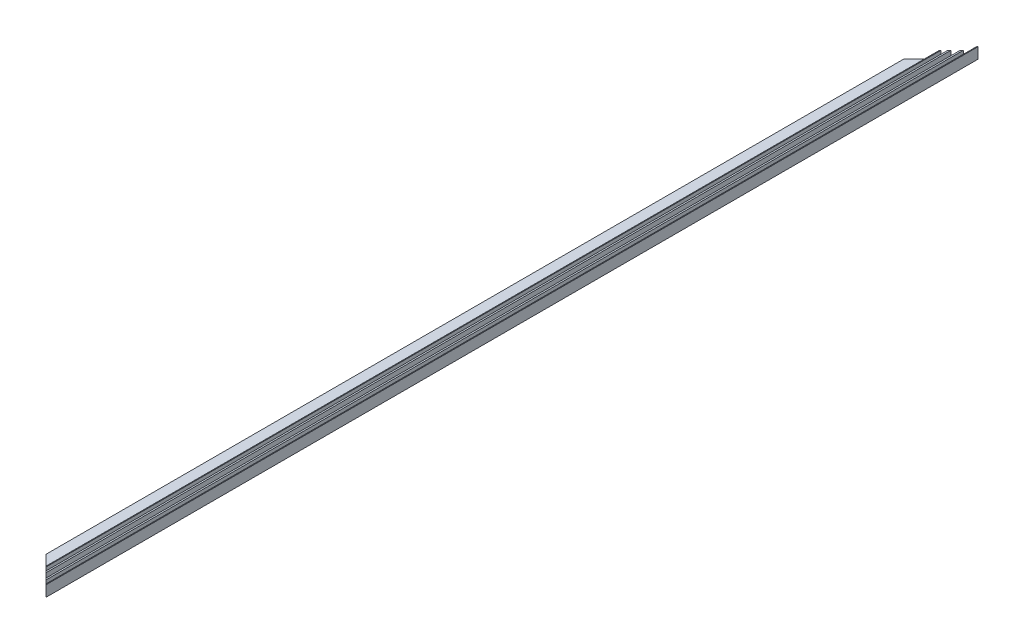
ISO-10303-21;
HEADER;
FILE_DESCRIPTION(('STEP AP214'),'2;1');
FILE_NAME('part.step','',(''),(''),'','','');
FILE_SCHEMA(('AUTOMOTIVE_DESIGN { 1 0 10303 214 1 1 1 1 }'));
ENDSEC;
DATA;
#1=APPLICATION_CONTEXT('core data for automotive mechanical design processes');
#2=APPLICATION_PROTOCOL_DEFINITION('international standard','automotive_design',2000,#1);
#3=PRODUCT_CONTEXT('',#1,'mechanical');
#4=PRODUCT('Part','Part','',(#3));
#5=PRODUCT_RELATED_PRODUCT_CATEGORY('part','',(#4));
#6=PRODUCT_DEFINITION_FORMATION('','',#4);
#7=PRODUCT_DEFINITION_CONTEXT('part definition',#1,'design');
#8=PRODUCT_DEFINITION('design','',#6,#7);
#9=PRODUCT_DEFINITION_SHAPE('','',#8);
#10=(LENGTH_UNIT() NAMED_UNIT(*) SI_UNIT(.MILLI.,.METRE.));
#11=(NAMED_UNIT(*) PLANE_ANGLE_UNIT() SI_UNIT($,.RADIAN.));
#12=(NAMED_UNIT(*) SI_UNIT($,.STERADIAN.) SOLID_ANGLE_UNIT());
#13=UNCERTAINTY_MEASURE_WITH_UNIT(LENGTH_MEASURE(1.E-05),#10,'distance_accuracy_value','');
#14=(GEOMETRIC_REPRESENTATION_CONTEXT(3) GLOBAL_UNCERTAINTY_ASSIGNED_CONTEXT((#13)) GLOBAL_UNIT_ASSIGNED_CONTEXT((#10,
#11,#12)) REPRESENTATION_CONTEXT('',''));
#15=CARTESIAN_POINT('',(0.,0.,0.));
#16=DIRECTION('',(0.,0.,1.));
#17=DIRECTION('',(1.,0.,0.));
#18=AXIS2_PLACEMENT_3D('',#15,#16,#17);
#19=CARTESIAN_POINT('',(-51.5554088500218,5.5,600.));
#20=DIRECTION('',(1.,0.,0.));
#21=DIRECTION('',(0.,0.,-1.));
#22=AXIS2_PLACEMENT_3D('',#19,#20,#21);
#23=PLANE('',#22);
#24=DIRECTION('',(0.,0.,-1.));
#25=VECTOR('',#24,1.);
#26=CARTESIAN_POINT('',(-51.5554088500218,0.50575390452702,600.));
#27=LINE('',#26,#25);
#28=CARTESIAN_POINT('',(-51.5554088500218,0.50575390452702,587.6));
#29=VERTEX_POINT('',#28);
#30=CARTESIAN_POINT('',(-51.5554088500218,0.50575390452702,12.3999999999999));
#31=VERTEX_POINT('',#30);
#32=EDGE_CURVE('E11',#29,#31,#27,.T.);
#33=ORIENTED_EDGE('',*,*,#32,.F.);
#34=DIRECTION('',(0.,1.,0.));
#35=VECTOR('',#34,1.);
#36=CARTESIAN_POINT('',(-51.5554088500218,5.5,587.6));
#37=LINE('',#36,#35);
#38=CARTESIAN_POINT('',(-51.5554088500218,5.5,587.6));
#39=VERTEX_POINT('',#38);
#40=EDGE_CURVE('E308',#29,#39,#37,.T.);
#41=ORIENTED_EDGE('',*,*,#40,.T.);
#42=DIRECTION('',(0.,0.,-1.));
#43=VECTOR('',#42,1.);
#44=CARTESIAN_POINT('',(-51.5554088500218,5.5,600.));
#45=LINE('',#44,#43);
#46=CARTESIAN_POINT('',(-51.5554088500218,5.5,12.3999999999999));
#47=VERTEX_POINT('',#46);
#48=EDGE_CURVE('E237',#39,#47,#45,.T.);
#49=ORIENTED_EDGE('',*,*,#48,.T.);
#50=DIRECTION('',(0.,-1.,0.));
#51=VECTOR('',#50,1.);
#52=CARTESIAN_POINT('',(-51.5554088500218,5.5,12.3999999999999));
#53=LINE('',#52,#51);
#54=EDGE_CURVE('E253',#47,#31,#53,.T.);
#55=ORIENTED_EDGE('',*,*,#54,.T.);
#56=EDGE_LOOP('',(#33,#41,#49,#55));
#57=FACE_BOUND('',#56,.T.);
#58=ADVANCED_FACE('F33',(#57),#23,.F.);
#59=CARTESIAN_POINT('',(-51.5554088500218,0.50575390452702,600.));
#60=DIRECTION('',(0.,-1.,0.));
#61=DIRECTION('',(1.,0.,0.));
#62=AXIS2_PLACEMENT_3D('',#59,#60,#61);
#63=PLANE('',#62);
#64=DIRECTION('',(0.,0.,-1.));
#65=VECTOR('',#64,1.);
#66=CARTESIAN_POINT('',(-63.1554088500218,0.505753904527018,600.));
#67=LINE('',#66,#65);
#68=CARTESIAN_POINT('',(-63.1554088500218,0.505753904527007,576.));
#69=VERTEX_POINT('',#68);
#70=CARTESIAN_POINT('',(-63.1554088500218,0.505753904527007,23.9999999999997));
#71=VERTEX_POINT('',#70);
#72=EDGE_CURVE('E41',#69,#71,#67,.T.);
#73=ORIENTED_EDGE('',*,*,#72,.F.);
#74=DIRECTION('',(0.707106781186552,0.,0.707106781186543));
#75=VECTOR('',#74,1.);
#76=CARTESIAN_POINT('',(-45.3554088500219,0.50575390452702,593.8));
#77=LINE('',#76,#75);
#78=EDGE_CURVE('E180',#69,#29,#77,.T.);
#79=ORIENTED_EDGE('',*,*,#78,.T.);
#80=ORIENTED_EDGE('',*,*,#32,.T.);
#81=DIRECTION('',(-0.707106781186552,0.,0.707106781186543));
#82=VECTOR('',#81,1.);
#83=CARTESIAN_POINT('',(-345.355408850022,0.505753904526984,306.199999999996));
#84=LINE('',#83,#82);
#85=EDGE_CURVE('E250',#31,#71,#84,.T.);
#86=ORIENTED_EDGE('',*,*,#85,.T.);
#87=EDGE_LOOP('',(#73,#79,#80,#86));
#88=FACE_BOUND('',#87,.T.);
#89=ADVANCED_FACE('F429',(#88),#63,.F.);
#90=CARTESIAN_POINT('',(-63.1554088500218,0.505753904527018,600.));
#91=DIRECTION('',(1.,0.,0.));
#92=DIRECTION('',(0.,0.,-1.));
#93=AXIS2_PLACEMENT_3D('',#90,#91,#92);
#94=PLANE('',#93);
#95=DIRECTION('',(0.,0.,-1.));
#96=VECTOR('',#95,1.);
#97=CARTESIAN_POINT('',(-63.1554088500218,0.,600.));
#98=LINE('',#97,#96);
#99=CARTESIAN_POINT('',(-63.1554088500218,0.,576.));
#100=VERTEX_POINT('',#99);
#101=CARTESIAN_POINT('',(-63.1554088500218,0.,23.9999999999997));
#102=VERTEX_POINT('',#101);
#103=EDGE_CURVE('E190',#100,#102,#98,.T.);
#104=ORIENTED_EDGE('',*,*,#103,.F.);
#105=DIRECTION('',(0.,-1.,0.));
#106=VECTOR('',#105,1.);
#107=CARTESIAN_POINT('',(-63.1554088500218,600.,576.));
#108=LINE('',#107,#106);
#109=EDGE_CURVE('E174',#69,#100,#108,.T.);
#110=ORIENTED_EDGE('',*,*,#109,.F.);
#111=ORIENTED_EDGE('',*,*,#72,.T.);
#112=DIRECTION('',(0.,-1.,0.));
#113=VECTOR('',#112,1.);
#114=CARTESIAN_POINT('',(-63.1554088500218,600.,23.9999999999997));
#115=LINE('',#114,#113);
#116=EDGE_CURVE('E197',#71,#102,#115,.T.);
#117=ORIENTED_EDGE('',*,*,#116,.T.);
#118=EDGE_LOOP('',(#104,#110,#111,#117));
#119=FACE_BOUND('',#118,.T.);
#120=ADVANCED_FACE('F195',(#119),#94,.F.);
#121=CARTESIAN_POINT('',(-63.1554088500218,0.,600.));
#122=DIRECTION('',(0.,1.,0.));
#123=DIRECTION('',(0.,0.,1.));
#124=AXIS2_PLACEMENT_3D('',#121,#122,#123);
#125=PLANE('',#124);
#126=DIRECTION('',(0.,0.,-1.));
#127=VECTOR('',#126,1.);
#128=CARTESIAN_POINT('',(-51.1554088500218,0.,600.));
#129=LINE('',#128,#127);
#130=CARTESIAN_POINT('',(-51.1554088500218,0.,588.));
#131=VERTEX_POINT('',#130);
#132=CARTESIAN_POINT('',(-51.1554088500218,0.,11.9999999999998));
#133=VERTEX_POINT('',#132);
#134=EDGE_CURVE('E192',#131,#133,#129,.T.);
#135=ORIENTED_EDGE('',*,*,#134,.F.);
#136=DIRECTION('',(0.707106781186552,0.,0.707106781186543));
#137=VECTOR('',#136,1.);
#138=CARTESIAN_POINT('',(-39.1554088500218,0.,600.));
#139=LINE('',#138,#137);
#140=EDGE_CURVE('E177',#100,#131,#139,.T.);
#141=ORIENTED_EDGE('',*,*,#140,.F.);
#142=ORIENTED_EDGE('',*,*,#103,.T.);
#143=DIRECTION('',(-0.707106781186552,0.,0.707106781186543));
#144=VECTOR('',#143,1.);
#145=CARTESIAN_POINT('',(-39.1554088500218,0.,0.));
#146=LINE('',#145,#144);
#147=EDGE_CURVE('E302',#133,#102,#146,.T.);
#148=ORIENTED_EDGE('',*,*,#147,.F.);
#149=EDGE_LOOP('',(#135,#141,#142,#148));
#150=FACE_BOUND('',#149,.T.);
#151=ADVANCED_FACE('F188',(#150),#125,.F.);
#152=CARTESIAN_POINT('',(-51.1554088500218,0.,600.));
#153=DIRECTION('',(-1.,0.,0.));
#154=DIRECTION('',(0.,0.,1.));
#155=AXIS2_PLACEMENT_3D('',#152,#153,#154);
#156=PLANE('',#155);
#157=DIRECTION('',(0.,0.,-1.));
#158=VECTOR('',#157,1.);
#159=CARTESIAN_POINT('',(-51.1554088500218,0.5,600.));
#160=LINE('',#159,#158);
#161=CARTESIAN_POINT('',(-51.1554088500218,0.5,588.));
#162=VERTEX_POINT('',#161);
#163=CARTESIAN_POINT('',(-51.1554088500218,0.5,11.9999999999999));
#164=VERTEX_POINT('',#163);
#165=EDGE_CURVE('E199',#162,#164,#160,.T.);
#166=ORIENTED_EDGE('',*,*,#165,.F.);
#167=DIRECTION('',(0.,-1.,0.));
#168=VECTOR('',#167,1.);
#169=CARTESIAN_POINT('',(-51.1554088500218,0.,588.));
#170=LINE('',#169,#168);
#171=EDGE_CURVE('E304',#162,#131,#170,.T.);
#172=ORIENTED_EDGE('',*,*,#171,.T.);
#173=ORIENTED_EDGE('',*,*,#134,.T.);
#174=DIRECTION('',(0.,1.,0.));
#175=VECTOR('',#174,1.);
#176=CARTESIAN_POINT('',(-51.1554088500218,0.,11.9999999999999));
#177=LINE('',#176,#175);
#178=EDGE_CURVE('E243',#133,#164,#177,.T.);
#179=ORIENTED_EDGE('',*,*,#178,.T.);
#180=EDGE_LOOP('',(#166,#172,#173,#179));
#181=FACE_BOUND('',#180,.T.);
#182=ADVANCED_FACE('F426',(#181),#156,.F.);
#183=CARTESIAN_POINT('',(-51.1554088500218,0.5,600.));
#184=DIRECTION('',(0.,1.,0.));
#185=DIRECTION('',(0.,0.,1.));
#186=AXIS2_PLACEMENT_3D('',#183,#184,#185);
#187=PLANE('',#186);
#188=DIRECTION('',(0.,0.,-1.));
#189=VECTOR('',#188,1.);
#190=CARTESIAN_POINT('',(-39.1554088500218,0.5,600.));
#191=LINE('',#190,#189);
#192=CARTESIAN_POINT('',(-39.1554088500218,0.5,600.));
#193=VERTEX_POINT('',#192);
#194=CARTESIAN_POINT('',(-39.1554088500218,0.499999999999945,0.));
#195=VERTEX_POINT('',#194);
#196=EDGE_CURVE('E203',#193,#195,#191,.T.);
#197=ORIENTED_EDGE('',*,*,#196,.F.);
#198=DIRECTION('',(-0.707106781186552,0.,-0.707106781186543));
#199=VECTOR('',#198,1.);
#200=CARTESIAN_POINT('',(-45.1554088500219,0.5,594.));
#201=LINE('',#200,#199);
#202=EDGE_CURVE('E47',#193,#162,#201,.T.);
#203=ORIENTED_EDGE('',*,*,#202,.T.);
#204=ORIENTED_EDGE('',*,*,#165,.T.);
#205=DIRECTION('',(0.707106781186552,0.,-0.707106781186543));
#206=VECTOR('',#205,1.);
#207=CARTESIAN_POINT('',(-345.155408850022,0.5,305.999999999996));
#208=LINE('',#207,#206);
#209=EDGE_CURVE('E247',#164,#195,#208,.T.);
#210=ORIENTED_EDGE('',*,*,#209,.T.);
#211=EDGE_LOOP('',(#197,#203,#204,#210));
#212=FACE_BOUND('',#211,.T.);
#213=ADVANCED_FACE('F423',(#212),#187,.F.);
#214=CARTESIAN_POINT('',(-39.1554088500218,0.5,600.));
#215=DIRECTION('',(-1.,0.,0.));
#216=DIRECTION('',(0.,0.,1.));
#217=AXIS2_PLACEMENT_3D('',#214,#215,#216);
#218=PLANE('',#217);
#219=DIRECTION('',(0.,1.,0.));
#220=VECTOR('',#219,1.);
#221=CARTESIAN_POINT('',(-39.1554088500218,0.5,0.));
#222=LINE('',#221,#220);
#223=CARTESIAN_POINT('',(-39.1554088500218,7.5,0.));
#224=VERTEX_POINT('',#223);
#225=EDGE_CURVE('E240',#195,#224,#222,.T.);
#226=ORIENTED_EDGE('',*,*,#225,.T.);
#227=DIRECTION('',(0.,0.,-1.));
#228=VECTOR('',#227,1.);
#229=CARTESIAN_POINT('',(-39.1554088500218,7.5,600.));
#230=LINE('',#229,#228);
#231=CARTESIAN_POINT('',(-39.1554088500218,7.49999999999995,600.));
#232=VERTEX_POINT('',#231);
#233=EDGE_CURVE('E206',#232,#224,#230,.T.);
#234=ORIENTED_EDGE('',*,*,#233,.F.);
#235=DIRECTION('',(0.,1.,0.));
#236=VECTOR('',#235,1.);
#237=CARTESIAN_POINT('',(-39.1554088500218,0.5,600.));
#238=LINE('',#237,#236);
#239=EDGE_CURVE('E239',#193,#232,#238,.T.);
#240=ORIENTED_EDGE('',*,*,#239,.F.);
#241=ORIENTED_EDGE('',*,*,#196,.T.);
#242=EDGE_LOOP('',(#226,#234,#240,#241));
#243=FACE_BOUND('',#242,.T.);
#244=ADVANCED_FACE('F419',(#243),#218,.F.);
#245=CARTESIAN_POINT('',(-39.1554088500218,7.5,600.));
#246=DIRECTION('',(0.,-1.,0.));
#247=DIRECTION('',(0.,0.,-1.));
#248=AXIS2_PLACEMENT_3D('',#245,#246,#247);
#249=PLANE('',#248);
#250=DIRECTION('',(0.,0.,-1.));
#251=VECTOR('',#250,1.);
#252=CARTESIAN_POINT('',(-39.6554088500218,7.5,600.));
#253=LINE('',#252,#251);
#254=CARTESIAN_POINT('',(-39.6554088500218,7.5,599.5));
#255=VERTEX_POINT('',#254);
#256=CARTESIAN_POINT('',(-39.6554088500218,7.5,0.500000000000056));
#257=VERTEX_POINT('',#256);
#258=EDGE_CURVE('E209',#255,#257,#253,.T.);
#259=ORIENTED_EDGE('',*,*,#258,.F.);
#260=DIRECTION('',(0.707106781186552,0.,0.707106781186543));
#261=VECTOR('',#260,1.);
#262=CARTESIAN_POINT('',(-39.1554088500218,7.5,600.));
#263=LINE('',#262,#261);
#264=EDGE_CURVE('E311',#255,#232,#263,.T.);
#265=ORIENTED_EDGE('',*,*,#264,.T.);
#266=ORIENTED_EDGE('',*,*,#233,.T.);
#267=DIRECTION('',(-0.707106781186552,0.,0.707106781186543));
#268=VECTOR('',#267,1.);
#269=CARTESIAN_POINT('',(-339.155408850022,7.5,299.999999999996));
#270=LINE('',#269,#268);
#271=EDGE_CURVE('E256',#224,#257,#270,.T.);
#272=ORIENTED_EDGE('',*,*,#271,.T.);
#273=EDGE_LOOP('',(#259,#265,#266,#272));
#274=FACE_BOUND('',#273,.T.);
#275=ADVANCED_FACE('F415',(#274),#249,.F.);
#276=CARTESIAN_POINT('',(-39.6554088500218,7.5,600.));
#277=DIRECTION('',(1.,0.,0.));
#278=DIRECTION('',(0.,0.,-1.));
#279=AXIS2_PLACEMENT_3D('',#276,#277,#278);
#280=PLANE('',#279);
#281=DIRECTION('',(0.,0.,-1.));
#282=VECTOR('',#281,1.);
#283=CARTESIAN_POINT('',(-39.6554088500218,5.5,600.));
#284=LINE('',#283,#282);
#285=CARTESIAN_POINT('',(-39.6554088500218,5.5,599.5));
#286=VERTEX_POINT('',#285);
#287=CARTESIAN_POINT('',(-39.6554088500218,5.5,0.500000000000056));
#288=VERTEX_POINT('',#287);
#289=EDGE_CURVE('E211',#286,#288,#284,.T.);
#290=ORIENTED_EDGE('',*,*,#289,.F.);
#291=DIRECTION('',(0.,1.,0.));
#292=VECTOR('',#291,1.);
#293=CARTESIAN_POINT('',(-39.6554088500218,7.5,599.5));
#294=LINE('',#293,#292);
#295=EDGE_CURVE('E314',#286,#255,#294,.T.);
#296=ORIENTED_EDGE('',*,*,#295,.T.);
#297=ORIENTED_EDGE('',*,*,#258,.T.);
#298=DIRECTION('',(0.,-1.,0.));
#299=VECTOR('',#298,1.);
#300=CARTESIAN_POINT('',(-39.6554088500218,7.5,0.500000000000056));
#301=LINE('',#300,#299);
#302=EDGE_CURVE('E259',#257,#288,#301,.T.);
#303=ORIENTED_EDGE('',*,*,#302,.T.);
#304=EDGE_LOOP('',(#290,#296,#297,#303));
#305=FACE_BOUND('',#304,.T.);
#306=ADVANCED_FACE('F412',(#305),#280,.F.);
#307=CARTESIAN_POINT('',(-39.6554088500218,5.5,600.));
#308=DIRECTION('',(0.,-1.,0.));
#309=DIRECTION('',(0.,0.,-1.));
#310=AXIS2_PLACEMENT_3D('',#307,#308,#309);
#311=PLANE('',#310);
#312=DIRECTION('',(0.,0.,-1.));
#313=VECTOR('',#312,1.);
#314=CARTESIAN_POINT('',(-40.6554088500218,5.5,600.));
#315=LINE('',#314,#313);
#316=CARTESIAN_POINT('',(-40.6554088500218,5.5,598.5));
#317=VERTEX_POINT('',#316);
#318=CARTESIAN_POINT('',(-40.6554088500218,5.5,1.49999999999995));
#319=VERTEX_POINT('',#318);
#320=EDGE_CURVE('E213',#317,#319,#315,.T.);
#321=ORIENTED_EDGE('',*,*,#320,.F.);
#322=DIRECTION('',(0.707106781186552,0.,0.707106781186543));
#323=VECTOR('',#322,1.);
#324=CARTESIAN_POINT('',(-39.4054088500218,5.5,599.75));
#325=LINE('',#324,#323);
#326=EDGE_CURVE('E317',#317,#286,#325,.T.);
#327=ORIENTED_EDGE('',*,*,#326,.T.);
#328=ORIENTED_EDGE('',*,*,#289,.T.);
#329=DIRECTION('',(-0.707106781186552,0.,0.707106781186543));
#330=VECTOR('',#329,1.);
#331=CARTESIAN_POINT('',(-339.405408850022,5.5,300.249999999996));
#332=LINE('',#331,#330);
#333=EDGE_CURVE('E262',#288,#319,#332,.T.);
#334=ORIENTED_EDGE('',*,*,#333,.T.);
#335=EDGE_LOOP('',(#321,#327,#328,#334));
#336=FACE_BOUND('',#335,.T.);
#337=ADVANCED_FACE('F409',(#336),#311,.F.);
#338=CARTESIAN_POINT('',(-40.6554088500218,5.5,600.));
#339=DIRECTION('',(1.,0.,0.));
#340=DIRECTION('',(0.,0.,-1.));
#341=AXIS2_PLACEMENT_3D('',#338,#339,#340);
#342=PLANE('',#341);
#343=DIRECTION('',(0.,0.,-1.));
#344=VECTOR('',#343,1.);
#345=CARTESIAN_POINT('',(-40.6554088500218,1.,600.));
#346=LINE('',#345,#344);
#347=CARTESIAN_POINT('',(-40.6554088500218,1.,598.5));
#348=VERTEX_POINT('',#347);
#349=CARTESIAN_POINT('',(-40.6554088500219,1.,1.50000000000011));
#350=VERTEX_POINT('',#349);
#351=EDGE_CURVE('E215',#348,#350,#346,.T.);
#352=ORIENTED_EDGE('',*,*,#351,.F.);
#353=DIRECTION('',(0.,1.,0.));
#354=VECTOR('',#353,1.);
#355=CARTESIAN_POINT('',(-40.6554088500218,5.5,598.5));
#356=LINE('',#355,#354);
#357=EDGE_CURVE('E320',#348,#317,#356,.T.);
#358=ORIENTED_EDGE('',*,*,#357,.T.);
#359=ORIENTED_EDGE('',*,*,#320,.T.);
#360=DIRECTION('',(0.,-1.,0.));
#361=VECTOR('',#360,1.);
#362=CARTESIAN_POINT('',(-40.6554088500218,5.5,1.49999999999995));
#363=LINE('',#362,#361);
#364=EDGE_CURVE('E265',#319,#350,#363,.T.);
#365=ORIENTED_EDGE('',*,*,#364,.T.);
#366=EDGE_LOOP('',(#352,#358,#359,#365));
#367=FACE_BOUND('',#366,.T.);
#368=ADVANCED_FACE('F404',(#367),#342,.F.);
#369=CARTESIAN_POINT('',(-40.6554088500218,1.,600.));
#370=DIRECTION('',(0.,-1.,0.));
#371=DIRECTION('',(1.,0.,0.));
#372=AXIS2_PLACEMENT_3D('',#369,#370,#371);
#373=PLANE('',#372);
#374=DIRECTION('',(0.,0.,-1.));
#375=VECTOR('',#374,1.);
#376=CARTESIAN_POINT('',(-43.8554088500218,1.,600.));
#377=LINE('',#376,#375);
#378=CARTESIAN_POINT('',(-43.8554088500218,1.,595.3));
#379=VERTEX_POINT('',#378);
#380=CARTESIAN_POINT('',(-43.8554088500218,1.,4.69999999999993));
#381=VERTEX_POINT('',#380);
#382=EDGE_CURVE('E217',#379,#381,#377,.T.);
#383=ORIENTED_EDGE('',*,*,#382,.F.);
#384=DIRECTION('',(0.707106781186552,0.,0.707106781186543));
#385=VECTOR('',#384,1.);
#386=CARTESIAN_POINT('',(-39.9054088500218,1.,599.25));
#387=LINE('',#386,#385);
#388=EDGE_CURVE('E323',#379,#348,#387,.T.);
#389=ORIENTED_EDGE('',*,*,#388,.T.);
#390=ORIENTED_EDGE('',*,*,#351,.T.);
#391=DIRECTION('',(-0.707106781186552,0.,0.707106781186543));
#392=VECTOR('',#391,1.);
#393=CARTESIAN_POINT('',(-339.905408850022,0.99999999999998,300.749999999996));
#394=LINE('',#393,#392);
#395=EDGE_CURVE('E268',#350,#381,#394,.T.);
#396=ORIENTED_EDGE('',*,*,#395,.T.);
#397=EDGE_LOOP('',(#383,#389,#390,#396));
#398=FACE_BOUND('',#397,.T.);
#399=ADVANCED_FACE('F401',(#398),#373,.F.);
#400=CARTESIAN_POINT('',(-43.8554088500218,1.,600.));
#401=DIRECTION('',(-1.,0.,0.));
#402=DIRECTION('',(0.,0.,1.));
#403=AXIS2_PLACEMENT_3D('',#400,#401,#402);
#404=PLANE('',#403);
#405=DIRECTION('',(0.,0.,-1.));
#406=VECTOR('',#405,1.);
#407=CARTESIAN_POINT('',(-43.8554088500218,5.5,600.));
#408=LINE('',#407,#406);
#409=CARTESIAN_POINT('',(-43.8554088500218,5.5,595.3));
#410=VERTEX_POINT('',#409);
#411=CARTESIAN_POINT('',(-43.8554088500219,5.5,4.70000000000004));
#412=VERTEX_POINT('',#411);
#413=EDGE_CURVE('E219',#410,#412,#408,.T.);
#414=ORIENTED_EDGE('',*,*,#413,.F.);
#415=DIRECTION('',(0.,-1.,0.));
#416=VECTOR('',#415,1.);
#417=CARTESIAN_POINT('',(-43.8554088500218,1.,595.3));
#418=LINE('',#417,#416);
#419=EDGE_CURVE('E326',#410,#379,#418,.T.);
#420=ORIENTED_EDGE('',*,*,#419,.T.);
#421=ORIENTED_EDGE('',*,*,#382,.T.);
#422=DIRECTION('',(0.,1.,0.));
#423=VECTOR('',#422,1.);
#424=CARTESIAN_POINT('',(-43.8554088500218,1.,4.69999999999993));
#425=LINE('',#424,#423);
#426=EDGE_CURVE('E271',#381,#412,#425,.T.);
#427=ORIENTED_EDGE('',*,*,#426,.T.);
#428=EDGE_LOOP('',(#414,#420,#421,#427));
#429=FACE_BOUND('',#428,.T.);
#430=ADVANCED_FACE('F396',(#429),#404,.F.);
#431=CARTESIAN_POINT('',(-43.8554088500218,5.5,600.));
#432=DIRECTION('',(0.,-1.,0.));
#433=DIRECTION('',(0.,0.,-1.));
#434=AXIS2_PLACEMENT_3D('',#431,#432,#433);
#435=PLANE('',#434);
#436=DIRECTION('',(0.,0.,-1.));
#437=VECTOR('',#436,1.);
#438=CARTESIAN_POINT('',(-44.8554088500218,5.5,600.));
#439=LINE('',#438,#437);
#440=CARTESIAN_POINT('',(-44.8554088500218,5.5,594.3));
#441=VERTEX_POINT('',#440);
#442=CARTESIAN_POINT('',(-44.8554088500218,5.5,5.69999999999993));
#443=VERTEX_POINT('',#442);
#444=EDGE_CURVE('E221',#441,#443,#439,.T.);
#445=ORIENTED_EDGE('',*,*,#444,.F.);
#446=DIRECTION('',(0.707106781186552,0.,0.707106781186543));
#447=VECTOR('',#446,1.);
#448=CARTESIAN_POINT('',(-41.5054088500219,5.5,597.65));
#449=LINE('',#448,#447);
#450=EDGE_CURVE('E329',#441,#410,#449,.T.);
#451=ORIENTED_EDGE('',*,*,#450,.T.);
#452=ORIENTED_EDGE('',*,*,#413,.T.);
#453=DIRECTION('',(-0.707106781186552,0.,0.707106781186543));
#454=VECTOR('',#453,1.);
#455=CARTESIAN_POINT('',(-341.505408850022,5.5,302.349999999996));
#456=LINE('',#455,#454);
#457=EDGE_CURVE('E274',#412,#443,#456,.T.);
#458=ORIENTED_EDGE('',*,*,#457,.T.);
#459=EDGE_LOOP('',(#445,#451,#452,#458));
#460=FACE_BOUND('',#459,.T.);
#461=ADVANCED_FACE('F393',(#460),#435,.F.);
#462=CARTESIAN_POINT('',(-44.8554088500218,5.5,600.));
#463=DIRECTION('',(1.,0.,0.));
#464=DIRECTION('',(0.,0.,-1.));
#465=AXIS2_PLACEMENT_3D('',#462,#463,#464);
#466=PLANE('',#465);
#467=DIRECTION('',(0.,0.,-1.));
#468=VECTOR('',#467,1.);
#469=CARTESIAN_POINT('',(-44.8554088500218,1.,600.));
#470=LINE('',#469,#468);
#471=CARTESIAN_POINT('',(-44.8554088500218,1.,594.3));
#472=VERTEX_POINT('',#471);
#473=CARTESIAN_POINT('',(-44.8554088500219,1.,5.69999999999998));
#474=VERTEX_POINT('',#473);
#475=EDGE_CURVE('E223',#472,#474,#470,.T.);
#476=ORIENTED_EDGE('',*,*,#475,.F.);
#477=DIRECTION('',(0.,1.,0.));
#478=VECTOR('',#477,1.);
#479=CARTESIAN_POINT('',(-44.8554088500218,5.5,594.3));
#480=LINE('',#479,#478);
#481=EDGE_CURVE('E332',#472,#441,#480,.T.);
#482=ORIENTED_EDGE('',*,*,#481,.T.);
#483=ORIENTED_EDGE('',*,*,#444,.T.);
#484=DIRECTION('',(0.,-1.,0.));
#485=VECTOR('',#484,1.);
#486=CARTESIAN_POINT('',(-44.8554088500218,5.5,5.69999999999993));
#487=LINE('',#486,#485);
#488=EDGE_CURVE('E277',#443,#474,#487,.T.);
#489=ORIENTED_EDGE('',*,*,#488,.T.);
#490=EDGE_LOOP('',(#476,#482,#483,#489));
#491=FACE_BOUND('',#490,.T.);
#492=ADVANCED_FACE('F388',(#491),#466,.F.);
#493=CARTESIAN_POINT('',(-44.8554088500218,1.,600.));
#494=DIRECTION('',(0.,-1.,0.));
#495=DIRECTION('',(1.,0.,0.));
#496=AXIS2_PLACEMENT_3D('',#493,#494,#495);
#497=PLANE('',#496);
#498=DIRECTION('',(0.,0.,-1.));
#499=VECTOR('',#498,1.);
#500=CARTESIAN_POINT('',(-47.8554088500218,0.999999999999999,600.));
#501=LINE('',#500,#499);
#502=CARTESIAN_POINT('',(-47.8554088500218,0.999999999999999,591.3));
#503=VERTEX_POINT('',#502);
#504=CARTESIAN_POINT('',(-47.8554088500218,0.999999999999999,8.69999999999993));
#505=VERTEX_POINT('',#504);
#506=EDGE_CURVE('E225',#503,#505,#501,.T.);
#507=ORIENTED_EDGE('',*,*,#506,.F.);
#508=DIRECTION('',(0.707106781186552,0.,0.707106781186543));
#509=VECTOR('',#508,1.);
#510=CARTESIAN_POINT('',(-42.0054088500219,1.,597.15));
#511=LINE('',#510,#509);
#512=EDGE_CURVE('E335',#503,#472,#511,.T.);
#513=ORIENTED_EDGE('',*,*,#512,.T.);
#514=ORIENTED_EDGE('',*,*,#475,.T.);
#515=DIRECTION('',(-0.707106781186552,0.,0.707106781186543));
#516=VECTOR('',#515,1.);
#517=CARTESIAN_POINT('',(-342.005408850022,0.999999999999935,302.849999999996));
#518=LINE('',#517,#516);
#519=EDGE_CURVE('E280',#474,#505,#518,.T.);
#520=ORIENTED_EDGE('',*,*,#519,.T.);
#521=EDGE_LOOP('',(#507,#513,#514,#520));
#522=FACE_BOUND('',#521,.T.);
#523=ADVANCED_FACE('F385',(#522),#497,.F.);
#524=CARTESIAN_POINT('',(-47.8554088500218,0.999999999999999,600.));
#525=DIRECTION('',(-1.,0.,0.));
#526=DIRECTION('',(0.,0.,1.));
#527=AXIS2_PLACEMENT_3D('',#524,#525,#526);
#528=PLANE('',#527);
#529=DIRECTION('',(0.,0.,-1.));
#530=VECTOR('',#529,1.);
#531=CARTESIAN_POINT('',(-47.8554088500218,5.5,600.));
#532=LINE('',#531,#530);
#533=CARTESIAN_POINT('',(-47.8554088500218,5.5,591.3));
#534=VERTEX_POINT('',#533);
#535=CARTESIAN_POINT('',(-47.8554088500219,5.5,8.69999999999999));
#536=VERTEX_POINT('',#535);
#537=EDGE_CURVE('E227',#534,#536,#532,.T.);
#538=ORIENTED_EDGE('',*,*,#537,.F.);
#539=DIRECTION('',(0.,-1.,0.));
#540=VECTOR('',#539,1.);
#541=CARTESIAN_POINT('',(-47.8554088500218,0.999999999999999,591.3));
#542=LINE('',#541,#540);
#543=EDGE_CURVE('E338',#534,#503,#542,.T.);
#544=ORIENTED_EDGE('',*,*,#543,.T.);
#545=ORIENTED_EDGE('',*,*,#506,.T.);
#546=DIRECTION('',(0.,1.,0.));
#547=VECTOR('',#546,1.);
#548=CARTESIAN_POINT('',(-47.8554088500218,0.999999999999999,8.69999999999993));
#549=LINE('',#548,#547);
#550=EDGE_CURVE('E283',#505,#536,#549,.T.);
#551=ORIENTED_EDGE('',*,*,#550,.T.);
#552=EDGE_LOOP('',(#538,#544,#545,#551));
#553=FACE_BOUND('',#552,.T.);
#554=ADVANCED_FACE('F380',(#553),#528,.F.);
#555=CARTESIAN_POINT('',(-47.8554088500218,5.5,600.));
#556=DIRECTION('',(0.,-1.,0.));
#557=DIRECTION('',(1.,0.,0.));
#558=AXIS2_PLACEMENT_3D('',#555,#556,#557);
#559=PLANE('',#558);
#560=DIRECTION('',(0.,0.,-1.));
#561=VECTOR('',#560,1.);
#562=CARTESIAN_POINT('',(-48.8554088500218,5.5,600.));
#563=LINE('',#562,#561);
#564=CARTESIAN_POINT('',(-48.8554088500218,5.5,590.3));
#565=VERTEX_POINT('',#564);
#566=CARTESIAN_POINT('',(-48.8554088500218,5.5,9.69999999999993));
#567=VERTEX_POINT('',#566);
#568=EDGE_CURVE('E229',#565,#567,#563,.T.);
#569=ORIENTED_EDGE('',*,*,#568,.F.);
#570=DIRECTION('',(0.707106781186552,0.,0.707106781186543));
#571=VECTOR('',#570,1.);
#572=CARTESIAN_POINT('',(-43.5054088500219,5.5,595.65));
#573=LINE('',#572,#571);
#574=EDGE_CURVE('E341',#565,#534,#573,.T.);
#575=ORIENTED_EDGE('',*,*,#574,.T.);
#576=ORIENTED_EDGE('',*,*,#537,.T.);
#577=DIRECTION('',(-0.707106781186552,0.,0.707106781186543));
#578=VECTOR('',#577,1.);
#579=CARTESIAN_POINT('',(-343.505408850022,5.49999999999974,304.349999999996));
#580=LINE('',#579,#578);
#581=EDGE_CURVE('E286',#536,#567,#580,.T.);
#582=ORIENTED_EDGE('',*,*,#581,.T.);
#583=EDGE_LOOP('',(#569,#575,#576,#582));
#584=FACE_BOUND('',#583,.T.);
#585=ADVANCED_FACE('F377',(#584),#559,.F.);
#586=CARTESIAN_POINT('',(-48.8554088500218,5.5,600.));
#587=DIRECTION('',(1.,0.,0.));
#588=DIRECTION('',(0.,0.,-1.));
#589=AXIS2_PLACEMENT_3D('',#586,#587,#588);
#590=PLANE('',#589);
#591=DIRECTION('',(0.,0.,-1.));
#592=VECTOR('',#591,1.);
#593=CARTESIAN_POINT('',(-48.8554088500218,0.999999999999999,600.));
#594=LINE('',#593,#592);
#595=CARTESIAN_POINT('',(-48.8554088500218,0.999999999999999,590.3));
#596=VERTEX_POINT('',#595);
#597=CARTESIAN_POINT('',(-48.8554088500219,0.999999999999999,9.69999999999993));
#598=VERTEX_POINT('',#597);
#599=EDGE_CURVE('E231',#596,#598,#594,.T.);
#600=ORIENTED_EDGE('',*,*,#599,.F.);
#601=DIRECTION('',(0.,1.,0.));
#602=VECTOR('',#601,1.);
#603=CARTESIAN_POINT('',(-48.8554088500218,5.5,590.3));
#604=LINE('',#603,#602);
#605=EDGE_CURVE('E344',#596,#565,#604,.T.);
#606=ORIENTED_EDGE('',*,*,#605,.T.);
#607=ORIENTED_EDGE('',*,*,#568,.T.);
#608=DIRECTION('',(0.,-1.,0.));
#609=VECTOR('',#608,1.);
#610=CARTESIAN_POINT('',(-48.8554088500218,5.5,9.69999999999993));
#611=LINE('',#610,#609);
#612=EDGE_CURVE('E289',#567,#598,#611,.T.);
#613=ORIENTED_EDGE('',*,*,#612,.T.);
#614=EDGE_LOOP('',(#600,#606,#607,#613));
#615=FACE_BOUND('',#614,.T.);
#616=ADVANCED_FACE('F372',(#615),#590,.F.);
#617=CARTESIAN_POINT('',(-48.8554088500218,0.999999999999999,600.));
#618=DIRECTION('',(0.,-1.,0.));
#619=DIRECTION('',(1.,0.,0.));
#620=AXIS2_PLACEMENT_3D('',#617,#618,#619);
#621=PLANE('',#620);
#622=DIRECTION('',(0.,0.,-1.));
#623=VECTOR('',#622,1.);
#624=CARTESIAN_POINT('',(-51.0554088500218,0.999999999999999,600.));
#625=LINE('',#624,#623);
#626=CARTESIAN_POINT('',(-51.0554088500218,0.999999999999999,588.1));
#627=VERTEX_POINT('',#626);
#628=CARTESIAN_POINT('',(-51.0554088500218,0.999999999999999,11.8999999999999));
#629=VERTEX_POINT('',#628);
#630=EDGE_CURVE('E233',#627,#629,#625,.T.);
#631=ORIENTED_EDGE('',*,*,#630,.F.);
#632=DIRECTION('',(0.707106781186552,0.,0.707106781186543));
#633=VECTOR('',#632,1.);
#634=CARTESIAN_POINT('',(-44.0054088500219,1.,595.15));
#635=LINE('',#634,#633);
#636=EDGE_CURVE('E347',#627,#596,#635,.T.);
#637=ORIENTED_EDGE('',*,*,#636,.T.);
#638=ORIENTED_EDGE('',*,*,#599,.T.);
#639=DIRECTION('',(-0.707106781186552,0.,0.707106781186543));
#640=VECTOR('',#639,1.);
#641=CARTESIAN_POINT('',(-344.005408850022,0.999999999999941,304.849999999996));
#642=LINE('',#641,#640);
#643=EDGE_CURVE('E292',#598,#629,#642,.T.);
#644=ORIENTED_EDGE('',*,*,#643,.T.);
#645=EDGE_LOOP('',(#631,#637,#638,#644));
#646=FACE_BOUND('',#645,.T.);
#647=ADVANCED_FACE('F369',(#646),#621,.F.);
#648=CARTESIAN_POINT('',(-51.0554088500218,0.999999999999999,600.));
#649=DIRECTION('',(-1.,0.,0.));
#650=DIRECTION('',(0.,-1.,0.));
#651=AXIS2_PLACEMENT_3D('',#648,#649,#650);
#652=PLANE('',#651);
#653=DIRECTION('',(0.,0.,-1.));
#654=VECTOR('',#653,1.);
#655=CARTESIAN_POINT('',(-51.0554088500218,5.5,600.));
#656=LINE('',#655,#654);
#657=CARTESIAN_POINT('',(-51.0554088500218,5.5,588.1));
#658=VERTEX_POINT('',#657);
#659=CARTESIAN_POINT('',(-51.0554088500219,5.5,11.8999999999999));
#660=VERTEX_POINT('',#659);
#661=EDGE_CURVE('E235',#658,#660,#656,.T.);
#662=ORIENTED_EDGE('',*,*,#661,.F.);
#663=DIRECTION('',(0.,-1.,0.));
#664=VECTOR('',#663,1.);
#665=CARTESIAN_POINT('',(-51.0554088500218,0.99999999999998,588.1));
#666=LINE('',#665,#664);
#667=EDGE_CURVE('E350',#658,#627,#666,.T.);
#668=ORIENTED_EDGE('',*,*,#667,.T.);
#669=ORIENTED_EDGE('',*,*,#630,.T.);
#670=DIRECTION('',(0.,1.,0.));
#671=VECTOR('',#670,1.);
#672=CARTESIAN_POINT('',(-51.0554088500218,1.00000000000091,11.8999999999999));
#673=LINE('',#672,#671);
#674=EDGE_CURVE('E295',#629,#660,#673,.T.);
#675=ORIENTED_EDGE('',*,*,#674,.T.);
#676=EDGE_LOOP('',(#662,#668,#669,#675));
#677=FACE_BOUND('',#676,.T.);
#678=ADVANCED_FACE('F360',(#677),#652,.F.);
#679=CARTESIAN_POINT('',(-51.0554088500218,5.5,600.));
#680=DIRECTION('',(0.,-1.,0.));
#681=DIRECTION('',(1.,0.,0.));
#682=AXIS2_PLACEMENT_3D('',#679,#680,#681);
#683=PLANE('',#682);
#684=ORIENTED_EDGE('',*,*,#48,.F.);
#685=DIRECTION('',(0.707106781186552,0.,0.707106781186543));
#686=VECTOR('',#685,1.);
#687=CARTESIAN_POINT('',(-45.1054088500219,5.49999999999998,594.05));
#688=LINE('',#687,#686);
#689=EDGE_CURVE('E184',#39,#658,#688,.T.);
#690=ORIENTED_EDGE('',*,*,#689,.T.);
#691=ORIENTED_EDGE('',*,*,#661,.T.);
#692=DIRECTION('',(-0.707106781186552,0.,0.707106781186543));
#693=VECTOR('',#692,1.);
#694=CARTESIAN_POINT('',(-345.105408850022,5.50000000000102,305.949999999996));
#695=LINE('',#694,#693);
#696=EDGE_CURVE('E298',#660,#47,#695,.T.);
#697=ORIENTED_EDGE('',*,*,#696,.T.);
#698=EDGE_LOOP('',(#684,#690,#691,#697));
#699=FACE_BOUND('',#698,.T.);
#700=ADVANCED_FACE('F357',(#699),#683,.F.);
#701=CARTESIAN_POINT('',(-39.1554088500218,600.,0.));
#702=DIRECTION('',(0.707106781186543,0.,0.707106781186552));
#703=DIRECTION('',(0.707106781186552,0.,-0.707106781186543));
#704=AXIS2_PLACEMENT_3D('',#701,#702,#703);
#705=PLANE('',#704);
#706=ORIENTED_EDGE('',*,*,#147,.T.);
#707=ORIENTED_EDGE('',*,*,#116,.F.);
#708=ORIENTED_EDGE('',*,*,#85,.F.);
#709=ORIENTED_EDGE('',*,*,#54,.F.);
#710=ORIENTED_EDGE('',*,*,#696,.F.);
#711=ORIENTED_EDGE('',*,*,#674,.F.);
#712=ORIENTED_EDGE('',*,*,#643,.F.);
#713=ORIENTED_EDGE('',*,*,#612,.F.);
#714=ORIENTED_EDGE('',*,*,#581,.F.);
#715=ORIENTED_EDGE('',*,*,#550,.F.);
#716=ORIENTED_EDGE('',*,*,#519,.F.);
#717=ORIENTED_EDGE('',*,*,#488,.F.);
#718=ORIENTED_EDGE('',*,*,#457,.F.);
#719=ORIENTED_EDGE('',*,*,#426,.F.);
#720=ORIENTED_EDGE('',*,*,#395,.F.);
#721=ORIENTED_EDGE('',*,*,#364,.F.);
#722=ORIENTED_EDGE('',*,*,#333,.F.);
#723=ORIENTED_EDGE('',*,*,#302,.F.);
#724=ORIENTED_EDGE('',*,*,#271,.F.);
#725=ORIENTED_EDGE('',*,*,#225,.F.);
#726=ORIENTED_EDGE('',*,*,#209,.F.);
#727=ORIENTED_EDGE('',*,*,#178,.F.);
#728=EDGE_LOOP('',(#706,#707,#708,#709,#710,#711,#712,#713,#714,#715,#716,#717,#718,#719,#720,
#721,#722,#723,#724,#725,#726,#727));
#729=FACE_BOUND('',#728,.T.);
#730=ADVANCED_FACE('F365',(#729),#705,.F.);
#731=CARTESIAN_POINT('',(-39.1554088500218,600.,600.));
#732=DIRECTION('',(0.707106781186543,0.,-0.707106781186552));
#733=DIRECTION('',(-0.707106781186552,0.,-0.707106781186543));
#734=AXIS2_PLACEMENT_3D('',#731,#732,#733);
#735=PLANE('',#734);
#736=ORIENTED_EDGE('',*,*,#202,.F.);
#737=ORIENTED_EDGE('',*,*,#239,.T.);
#738=ORIENTED_EDGE('',*,*,#264,.F.);
#739=ORIENTED_EDGE('',*,*,#295,.F.);
#740=ORIENTED_EDGE('',*,*,#326,.F.);
#741=ORIENTED_EDGE('',*,*,#357,.F.);
#742=ORIENTED_EDGE('',*,*,#388,.F.);
#743=ORIENTED_EDGE('',*,*,#419,.F.);
#744=ORIENTED_EDGE('',*,*,#450,.F.);
#745=ORIENTED_EDGE('',*,*,#481,.F.);
#746=ORIENTED_EDGE('',*,*,#512,.F.);
#747=ORIENTED_EDGE('',*,*,#543,.F.);
#748=ORIENTED_EDGE('',*,*,#574,.F.);
#749=ORIENTED_EDGE('',*,*,#605,.F.);
#750=ORIENTED_EDGE('',*,*,#636,.F.);
#751=ORIENTED_EDGE('',*,*,#667,.F.);
#752=ORIENTED_EDGE('',*,*,#689,.F.);
#753=ORIENTED_EDGE('',*,*,#40,.F.);
#754=ORIENTED_EDGE('',*,*,#78,.F.);
#755=ORIENTED_EDGE('',*,*,#109,.T.);
#756=ORIENTED_EDGE('',*,*,#140,.T.);
#757=ORIENTED_EDGE('',*,*,#171,.F.);
#758=EDGE_LOOP('',(#736,#737,#738,#739,#740,#741,#742,#743,#744,#745,#746,#747,#748,#749,#750,
#751,#752,#753,#754,#755,#756,#757));
#759=FACE_BOUND('',#758,.T.);
#760=ADVANCED_FACE('F176',(#759),#735,.F.);
#761=CLOSED_SHELL('',(#58,#89,#120,#151,#182,#213,#244,#275,#306,#337,#368,#399,#430,#461,#492,
#523,#554,#585,#616,#647,#678,#700,#730,#760));
#762=MANIFOLD_SOLID_BREP('B2',#761);
#763=ADVANCED_BREP_SHAPE_REPRESENTATION('',(#18,#762),#14);
#764=SHAPE_DEFINITION_REPRESENTATION(#9,#763);
ENDSEC;
END-ISO-10303-21;
